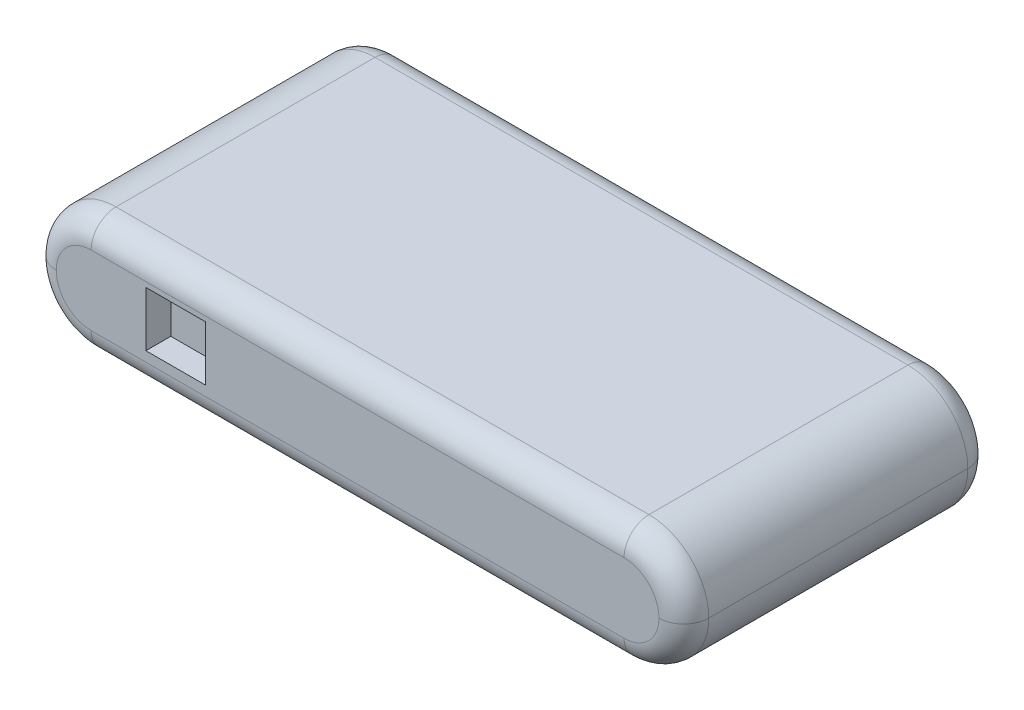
ISO-10303-21;
HEADER;
FILE_DESCRIPTION(('STEP AP214'),'2;1');
FILE_NAME('part.step','',(''),(''),'','','');
FILE_SCHEMA(('AUTOMOTIVE_DESIGN { 1 0 10303 214 1 1 1 1 }'));
ENDSEC;
DATA;
#1=APPLICATION_CONTEXT('core data for automotive mechanical design processes');
#2=APPLICATION_PROTOCOL_DEFINITION('international standard','automotive_design',2000,#1);
#3=PRODUCT_CONTEXT('',#1,'mechanical');
#4=PRODUCT('Part','Part','',(#3));
#5=PRODUCT_RELATED_PRODUCT_CATEGORY('part','',(#4));
#6=PRODUCT_DEFINITION_FORMATION('','',#4);
#7=PRODUCT_DEFINITION_CONTEXT('part definition',#1,'design');
#8=PRODUCT_DEFINITION('design','',#6,#7);
#9=PRODUCT_DEFINITION_SHAPE('','',#8);
#10=(LENGTH_UNIT() NAMED_UNIT(*) SI_UNIT(.MILLI.,.METRE.));
#11=(NAMED_UNIT(*) PLANE_ANGLE_UNIT() SI_UNIT($,.RADIAN.));
#12=(NAMED_UNIT(*) SI_UNIT($,.STERADIAN.) SOLID_ANGLE_UNIT());
#13=UNCERTAINTY_MEASURE_WITH_UNIT(LENGTH_MEASURE(1.E-05),#10,'distance_accuracy_value','');
#14=(GEOMETRIC_REPRESENTATION_CONTEXT(3) GLOBAL_UNCERTAINTY_ASSIGNED_CONTEXT((#13)) GLOBAL_UNIT_ASSIGNED_CONTEXT((#10,
#11,#12)) REPRESENTATION_CONTEXT('',''));
#15=CARTESIAN_POINT('',(0.,0.,0.));
#16=DIRECTION('',(0.,0.,1.));
#17=DIRECTION('',(1.,0.,0.));
#18=AXIS2_PLACEMENT_3D('',#15,#16,#17);
#19=CARTESIAN_POINT('',(-65.5,24.,-31.));
#20=DIRECTION('',(0.,0.,1.));
#21=DIRECTION('',(1.,0.,0.));
#22=AXIS2_PLACEMENT_3D('',#19,#20,#21);
#23=PLANE('',#22);
#24=CARTESIAN_POINT('',(37.5,13.,-31.));
#25=DIRECTION('',(0.,0.,-1.));
#26=DIRECTION('',(-1.,0.,0.));
#27=AXIS2_PLACEMENT_3D('',#24,#25,#26);
#28=CIRCLE('',#27,1.75);
#29=CARTESIAN_POINT('',(35.75,13.,-31.));
#30=VERTEX_POINT('',#29);
#31=EDGE_CURVE('E662',#30,#30,#28,.T.);
#32=ORIENTED_EDGE('',*,*,#31,.F.);
#33=EDGE_LOOP('',(#32));
#34=FACE_BOUND('',#33,.T.);
#35=CARTESIAN_POINT('',(22.5,13.,-31.));
#36=DIRECTION('',(0.,0.,-1.));
#37=DIRECTION('',(-1.,0.,0.));
#38=AXIS2_PLACEMENT_3D('',#35,#36,#37);
#39=CIRCLE('',#38,1.75);
#40=CARTESIAN_POINT('',(20.75,13.,-31.));
#41=VERTEX_POINT('',#40);
#42=EDGE_CURVE('E670',#41,#41,#39,.T.);
#43=ORIENTED_EDGE('',*,*,#42,.F.);
#44=EDGE_LOOP('',(#43));
#45=FACE_BOUND('',#44,.T.);
#46=CARTESIAN_POINT('',(7.50000000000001,13.,-31.));
#47=DIRECTION('',(0.,0.,-1.));
#48=DIRECTION('',(-1.,0.,0.));
#49=AXIS2_PLACEMENT_3D('',#46,#47,#48);
#50=CIRCLE('',#49,1.75);
#51=CARTESIAN_POINT('',(5.75,13.,-31.));
#52=VERTEX_POINT('',#51);
#53=EDGE_CURVE('E676',#52,#52,#50,.T.);
#54=ORIENTED_EDGE('',*,*,#53,.F.);
#55=EDGE_LOOP('',(#54));
#56=FACE_BOUND('',#55,.T.);
#57=CARTESIAN_POINT('',(-7.49999999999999,13.,-31.));
#58=DIRECTION('',(0.,0.,-1.));
#59=DIRECTION('',(-1.,0.,0.));
#60=AXIS2_PLACEMENT_3D('',#57,#58,#59);
#61=CIRCLE('',#60,1.75);
#62=CARTESIAN_POINT('',(-9.25,13.,-31.));
#63=VERTEX_POINT('',#62);
#64=EDGE_CURVE('E682',#63,#63,#61,.T.);
#65=ORIENTED_EDGE('',*,*,#64,.F.);
#66=EDGE_LOOP('',(#65));
#67=FACE_BOUND('',#66,.T.);
#68=CARTESIAN_POINT('',(-22.5,13.,-31.));
#69=DIRECTION('',(0.,0.,-1.));
#70=DIRECTION('',(-1.,0.,0.));
#71=AXIS2_PLACEMENT_3D('',#68,#69,#70);
#72=CIRCLE('',#71,1.75);
#73=CARTESIAN_POINT('',(-24.25,13.,-31.));
#74=VERTEX_POINT('',#73);
#75=EDGE_CURVE('E688',#74,#74,#72,.T.);
#76=ORIENTED_EDGE('',*,*,#75,.F.);
#77=EDGE_LOOP('',(#76));
#78=FACE_BOUND('',#77,.T.);
#79=CARTESIAN_POINT('',(-37.5,13.,-31.));
#80=DIRECTION('',(0.,0.,-1.));
#81=DIRECTION('',(-1.,0.,0.));
#82=AXIS2_PLACEMENT_3D('',#79,#80,#81);
#83=CIRCLE('',#82,1.75);
#84=CARTESIAN_POINT('',(-39.25,13.,-31.));
#85=VERTEX_POINT('',#84);
#86=EDGE_CURVE('E176',#85,#85,#83,.T.);
#87=ORIENTED_EDGE('',*,*,#86,.F.);
#88=EDGE_LOOP('',(#87));
#89=FACE_BOUND('',#88,.T.);
#90=CARTESIAN_POINT('',(53.5,12.,-31.));
#91=DIRECTION('',(0.,0.,1.));
#92=DIRECTION('',(1.,0.,0.));
#93=AXIS2_PLACEMENT_3D('',#90,#91,#92);
#94=CIRCLE('',#93,7.);
#95=CARTESIAN_POINT('',(53.5,19.,-31.));
#96=VERTEX_POINT('',#95);
#97=CARTESIAN_POINT('',(60.5,12.,-31.));
#98=VERTEX_POINT('',#97);
#99=EDGE_CURVE('E218',#96,#98,#94,.F.);
#100=ORIENTED_EDGE('',*,*,#99,.T.);
#101=CARTESIAN_POINT('',(53.5,12.,-31.));
#102=DIRECTION('',(0.,0.,1.));
#103=DIRECTION('',(1.,0.,0.));
#104=AXIS2_PLACEMENT_3D('',#101,#102,#103);
#105=CIRCLE('',#104,7.);
#106=CARTESIAN_POINT('',(53.5,5.,-31.));
#107=VERTEX_POINT('',#106);
#108=EDGE_CURVE('E223',#98,#107,#105,.F.);
#109=ORIENTED_EDGE('',*,*,#108,.T.);
#110=DIRECTION('',(-1.,0.,0.));
#111=VECTOR('',#110,1.);
#112=CARTESIAN_POINT('',(-53.5,5.,-31.));
#113=LINE('',#112,#111);
#114=CARTESIAN_POINT('',(-53.5,5.,-31.));
#115=VERTEX_POINT('',#114);
#116=EDGE_CURVE('E221',#107,#115,#113,.T.);
#117=ORIENTED_EDGE('',*,*,#116,.T.);
#118=CARTESIAN_POINT('',(-53.5,12.,-31.));
#119=DIRECTION('',(0.,0.,1.));
#120=DIRECTION('',(1.,0.,0.));
#121=AXIS2_PLACEMENT_3D('',#118,#119,#120);
#122=CIRCLE('',#121,7.);
#123=CARTESIAN_POINT('',(-60.5,12.,-31.));
#124=VERTEX_POINT('',#123);
#125=EDGE_CURVE('E216',#115,#124,#122,.F.);
#126=ORIENTED_EDGE('',*,*,#125,.T.);
#127=CARTESIAN_POINT('',(-53.5,12.,-31.));
#128=DIRECTION('',(0.,0.,1.));
#129=DIRECTION('',(1.,0.,0.));
#130=AXIS2_PLACEMENT_3D('',#127,#128,#129);
#131=CIRCLE('',#130,7.);
#132=CARTESIAN_POINT('',(-53.5,19.,-31.));
#133=VERTEX_POINT('',#132);
#134=EDGE_CURVE('E214',#124,#133,#131,.F.);
#135=ORIENTED_EDGE('',*,*,#134,.T.);
#136=DIRECTION('',(-1.,0.,0.));
#137=VECTOR('',#136,1.);
#138=CARTESIAN_POINT('',(-65.5,19.,-31.));
#139=LINE('',#138,#137);
#140=EDGE_CURVE('E206',#133,#96,#139,.F.);
#141=ORIENTED_EDGE('',*,*,#140,.T.);
#142=EDGE_LOOP('',(#100,#109,#117,#126,#135,#141));
#143=FACE_BOUND('',#142,.T.);
#144=ADVANCED_FACE('F35',(#34,#45,#56,#67,#78,#89,#143),#23,.F.);
#145=CARTESIAN_POINT('',(-65.5,24.,31.));
#146=DIRECTION('',(0.,0.,-1.));
#147=DIRECTION('',(-1.,0.,0.));
#148=AXIS2_PLACEMENT_3D('',#145,#146,#147);
#149=PLANE('',#148);
#150=DIRECTION('',(1.,0.,0.));
#151=VECTOR('',#150,1.);
#152=CARTESIAN_POINT('',(-42.5,7.,31.));
#153=LINE('',#152,#151);
#154=CARTESIAN_POINT('',(-42.5,7.,31.));
#155=VERTEX_POINT('',#154);
#156=CARTESIAN_POINT('',(-30.5,7.,31.));
#157=VERTEX_POINT('',#156);
#158=EDGE_CURVE('E182',#155,#157,#153,.T.);
#159=ORIENTED_EDGE('',*,*,#158,.F.);
#160=DIRECTION('',(0.,-1.,0.));
#161=VECTOR('',#160,1.);
#162=CARTESIAN_POINT('',(-42.5,18.,31.));
#163=LINE('',#162,#161);
#164=CARTESIAN_POINT('',(-42.5,18.,31.));
#165=VERTEX_POINT('',#164);
#166=EDGE_CURVE('E52',#165,#155,#163,.T.);
#167=ORIENTED_EDGE('',*,*,#166,.F.);
#168=DIRECTION('',(-1.,0.,0.));
#169=VECTOR('',#168,1.);
#170=CARTESIAN_POINT('',(-42.5,18.,31.));
#171=LINE('',#170,#169);
#172=CARTESIAN_POINT('',(-30.5,18.,31.));
#173=VERTEX_POINT('',#172);
#174=EDGE_CURVE('E170',#173,#165,#171,.T.);
#175=ORIENTED_EDGE('',*,*,#174,.F.);
#176=DIRECTION('',(0.,1.,0.));
#177=VECTOR('',#176,1.);
#178=CARTESIAN_POINT('',(-30.5,18.,31.));
#179=LINE('',#178,#177);
#180=EDGE_CURVE('E173',#157,#173,#179,.T.);
#181=ORIENTED_EDGE('',*,*,#180,.F.);
#182=EDGE_LOOP('',(#159,#167,#175,#181));
#183=FACE_BOUND('',#182,.T.);
#184=CARTESIAN_POINT('',(-53.5,12.,31.));
#185=DIRECTION('',(0.,0.,-1.));
#186=DIRECTION('',(-1.,0.,0.));
#187=AXIS2_PLACEMENT_3D('',#184,#185,#186);
#188=CIRCLE('',#187,7.);
#189=CARTESIAN_POINT('',(-53.5,19.,31.));
#190=VERTEX_POINT('',#189);
#191=CARTESIAN_POINT('',(-60.5,12.,31.));
#192=VERTEX_POINT('',#191);
#193=EDGE_CURVE('E249',#190,#192,#188,.F.);
#194=ORIENTED_EDGE('',*,*,#193,.T.);
#195=CARTESIAN_POINT('',(-53.5,12.,31.));
#196=DIRECTION('',(0.,0.,-1.));
#197=DIRECTION('',(-1.,0.,0.));
#198=AXIS2_PLACEMENT_3D('',#195,#196,#197);
#199=CIRCLE('',#198,7.);
#200=CARTESIAN_POINT('',(-53.5,5.,31.));
#201=VERTEX_POINT('',#200);
#202=EDGE_CURVE('E60',#192,#201,#199,.F.);
#203=ORIENTED_EDGE('',*,*,#202,.T.);
#204=DIRECTION('',(1.,0.,0.));
#205=VECTOR('',#204,1.);
#206=CARTESIAN_POINT('',(53.5,5.,31.));
#207=LINE('',#206,#205);
#208=CARTESIAN_POINT('',(53.5,5.,31.));
#209=VERTEX_POINT('',#208);
#210=EDGE_CURVE('E251',#201,#209,#207,.T.);
#211=ORIENTED_EDGE('',*,*,#210,.T.);
#212=CARTESIAN_POINT('',(53.5,12.,31.));
#213=DIRECTION('',(0.,0.,-1.));
#214=DIRECTION('',(-1.,0.,0.));
#215=AXIS2_PLACEMENT_3D('',#212,#213,#214);
#216=CIRCLE('',#215,7.);
#217=CARTESIAN_POINT('',(60.5,12.,31.));
#218=VERTEX_POINT('',#217);
#219=EDGE_CURVE('E247',#209,#218,#216,.F.);
#220=ORIENTED_EDGE('',*,*,#219,.T.);
#221=CARTESIAN_POINT('',(53.5,12.,31.));
#222=DIRECTION('',(0.,0.,-1.));
#223=DIRECTION('',(-1.,0.,0.));
#224=AXIS2_PLACEMENT_3D('',#221,#222,#223);
#225=CIRCLE('',#224,7.);
#226=CARTESIAN_POINT('',(53.5,19.,31.));
#227=VERTEX_POINT('',#226);
#228=EDGE_CURVE('E245',#218,#227,#225,.F.);
#229=ORIENTED_EDGE('',*,*,#228,.T.);
#230=DIRECTION('',(1.,0.,0.));
#231=VECTOR('',#230,1.);
#232=CARTESIAN_POINT('',(-65.5,19.,31.));
#233=LINE('',#232,#231);
#234=EDGE_CURVE('E243',#227,#190,#233,.F.);
#235=ORIENTED_EDGE('',*,*,#234,.T.);
#236=EDGE_LOOP('',(#194,#203,#211,#220,#229,#235));
#237=FACE_BOUND('',#236,.T.);
#238=ADVANCED_FACE('F356',(#183,#237),#149,.F.);
#239=CARTESIAN_POINT('',(0.,24.,0.));
#240=DIRECTION('',(0.,-1.,0.));
#241=DIRECTION('',(0.,0.,-1.));
#242=AXIS2_PLACEMENT_3D('',#239,#240,#241);
#243=PLANE('',#242);
#244=DIRECTION('',(0.,0.,-1.));
#245=VECTOR('',#244,1.);
#246=CARTESIAN_POINT('',(53.5,24.,0.));
#247=LINE('',#246,#245);
#248=CARTESIAN_POINT('',(53.5,24.,26.));
#249=VERTEX_POINT('',#248);
#250=CARTESIAN_POINT('',(53.5,24.,-26.));
#251=VERTEX_POINT('',#250);
#252=EDGE_CURVE('E196',#249,#251,#247,.T.);
#253=ORIENTED_EDGE('',*,*,#252,.T.);
#254=DIRECTION('',(-1.,0.,0.));
#255=VECTOR('',#254,1.);
#256=CARTESIAN_POINT('',(0.,24.,-26.));
#257=LINE('',#256,#255);
#258=CARTESIAN_POINT('',(-53.5,24.,-26.));
#259=VERTEX_POINT('',#258);
#260=EDGE_CURVE('E11',#251,#259,#257,.T.);
#261=ORIENTED_EDGE('',*,*,#260,.T.);
#262=DIRECTION('',(0.,0.,1.));
#263=VECTOR('',#262,1.);
#264=CARTESIAN_POINT('',(-53.5,24.,0.));
#265=LINE('',#264,#263);
#266=CARTESIAN_POINT('',(-53.5,24.,26.));
#267=VERTEX_POINT('',#266);
#268=EDGE_CURVE('E193',#259,#267,#265,.T.);
#269=ORIENTED_EDGE('',*,*,#268,.T.);
#270=DIRECTION('',(1.,0.,0.));
#271=VECTOR('',#270,1.);
#272=CARTESIAN_POINT('',(0.,24.,26.));
#273=LINE('',#272,#271);
#274=EDGE_CURVE('E44',#267,#249,#273,.T.);
#275=ORIENTED_EDGE('',*,*,#274,.T.);
#276=EDGE_LOOP('',(#253,#261,#269,#275));
#277=FACE_BOUND('',#276,.T.);
#278=ADVANCED_FACE('F330',(#277),#243,.F.);
#279=CARTESIAN_POINT('',(0.,0.,0.));
#280=DIRECTION('',(0.,-1.,0.));
#281=DIRECTION('',(0.,0.,-1.));
#282=AXIS2_PLACEMENT_3D('',#279,#280,#281);
#283=PLANE('',#282);
#284=DIRECTION('',(0.,0.,1.));
#285=VECTOR('',#284,1.);
#286=CARTESIAN_POINT('',(-53.5,0.,-31.));
#287=LINE('',#286,#285);
#288=CARTESIAN_POINT('',(-53.5,0.,26.));
#289=VERTEX_POINT('',#288);
#290=CARTESIAN_POINT('',(-53.5,0.,-26.));
#291=VERTEX_POINT('',#290);
#292=EDGE_CURVE('E200',#289,#291,#287,.F.);
#293=ORIENTED_EDGE('',*,*,#292,.T.);
#294=DIRECTION('',(-1.,0.,0.));
#295=VECTOR('',#294,1.);
#296=CARTESIAN_POINT('',(53.5,0.,-26.));
#297=LINE('',#296,#295);
#298=CARTESIAN_POINT('',(53.5,0.,-26.));
#299=VERTEX_POINT('',#298);
#300=EDGE_CURVE('E256',#291,#299,#297,.F.);
#301=ORIENTED_EDGE('',*,*,#300,.T.);
#302=DIRECTION('',(0.,0.,-1.));
#303=VECTOR('',#302,1.);
#304=CARTESIAN_POINT('',(53.5,0.,31.));
#305=LINE('',#304,#303);
#306=CARTESIAN_POINT('',(53.5,0.,26.));
#307=VERTEX_POINT('',#306);
#308=EDGE_CURVE('E203',#299,#307,#305,.F.);
#309=ORIENTED_EDGE('',*,*,#308,.T.);
#310=DIRECTION('',(1.,0.,0.));
#311=VECTOR('',#310,1.);
#312=CARTESIAN_POINT('',(-53.5,0.,26.));
#313=LINE('',#312,#311);
#314=EDGE_CURVE('E254',#307,#289,#313,.F.);
#315=ORIENTED_EDGE('',*,*,#314,.T.);
#316=EDGE_LOOP('',(#293,#301,#309,#315));
#317=FACE_BOUND('',#316,.T.);
#318=ADVANCED_FACE('F303',(#317),#283,.T.);
#319=CARTESIAN_POINT('',(53.5,12.,31.));
#320=DIRECTION('',(0.,0.,1.));
#321=DIRECTION('',(1.,0.,0.));
#322=AXIS2_PLACEMENT_3D('',#319,#320,#321);
#323=CYLINDRICAL_SURFACE('',#322,12.);
#324=ORIENTED_EDGE('',*,*,#308,.F.);
#325=CARTESIAN_POINT('',(53.5,12.,-26.));
#326=DIRECTION('',(0.,0.,1.));
#327=DIRECTION('',(1.,0.,0.));
#328=AXIS2_PLACEMENT_3D('',#325,#326,#327);
#329=CIRCLE('',#328,12.);
#330=CARTESIAN_POINT('',(65.5,12.,-26.));
#331=VERTEX_POINT('',#330);
#332=EDGE_CURVE('E232',#299,#331,#329,.T.);
#333=ORIENTED_EDGE('',*,*,#332,.T.);
#334=DIRECTION('',(0.,0.,-1.));
#335=VECTOR('',#334,1.);
#336=CARTESIAN_POINT('',(65.5,12.,-31.));
#337=LINE('',#336,#335);
#338=CARTESIAN_POINT('',(65.5,12.,26.));
#339=VERTEX_POINT('',#338);
#340=EDGE_CURVE('E197',#339,#331,#337,.T.);
#341=ORIENTED_EDGE('',*,*,#340,.F.);
#342=CARTESIAN_POINT('',(53.5,12.,26.));
#343=DIRECTION('',(0.,0.,-1.));
#344=DIRECTION('',(-1.,0.,0.));
#345=AXIS2_PLACEMENT_3D('',#342,#343,#344);
#346=CIRCLE('',#345,12.);
#347=EDGE_CURVE('E230',#339,#307,#346,.T.);
#348=ORIENTED_EDGE('',*,*,#347,.T.);
#349=EDGE_LOOP('',(#324,#333,#341,#348));
#350=FACE_BOUND('',#349,.T.);
#351=ADVANCED_FACE('F300',(#350),#323,.T.);
#352=CARTESIAN_POINT('',(53.5,12.,0.));
#353=DIRECTION('',(0.,0.,-1.));
#354=DIRECTION('',(-1.,0.,0.));
#355=AXIS2_PLACEMENT_3D('',#352,#353,#354);
#356=CYLINDRICAL_SURFACE('',#355,12.);
#357=ORIENTED_EDGE('',*,*,#340,.T.);
#358=CARTESIAN_POINT('',(53.5,12.,-26.));
#359=DIRECTION('',(0.,0.,1.));
#360=DIRECTION('',(1.,0.,0.));
#361=AXIS2_PLACEMENT_3D('',#358,#359,#360);
#362=CIRCLE('',#361,12.);
#363=EDGE_CURVE('E227',#331,#251,#362,.T.);
#364=ORIENTED_EDGE('',*,*,#363,.T.);
#365=ORIENTED_EDGE('',*,*,#252,.F.);
#366=CARTESIAN_POINT('',(53.5,12.,26.));
#367=DIRECTION('',(0.,0.,-1.));
#368=DIRECTION('',(-1.,0.,0.));
#369=AXIS2_PLACEMENT_3D('',#366,#367,#368);
#370=CIRCLE('',#369,12.);
#371=EDGE_CURVE('E225',#249,#339,#370,.T.);
#372=ORIENTED_EDGE('',*,*,#371,.T.);
#373=EDGE_LOOP('',(#357,#364,#365,#372));
#374=FACE_BOUND('',#373,.T.);
#375=ADVANCED_FACE('F317',(#374),#356,.T.);
#376=CARTESIAN_POINT('',(-53.5,12.,0.));
#377=DIRECTION('',(0.,0.,1.));
#378=DIRECTION('',(1.,0.,0.));
#379=AXIS2_PLACEMENT_3D('',#376,#377,#378);
#380=CYLINDRICAL_SURFACE('',#379,12.);
#381=ORIENTED_EDGE('',*,*,#268,.F.);
#382=CARTESIAN_POINT('',(-53.5,12.,-26.));
#383=DIRECTION('',(0.,0.,1.));
#384=DIRECTION('',(1.,0.,0.));
#385=AXIS2_PLACEMENT_3D('',#382,#383,#384);
#386=CIRCLE('',#385,12.);
#387=CARTESIAN_POINT('',(-65.5,12.,-26.));
#388=VERTEX_POINT('',#387);
#389=EDGE_CURVE('E241',#259,#388,#386,.T.);
#390=ORIENTED_EDGE('',*,*,#389,.T.);
#391=DIRECTION('',(0.,0.,1.));
#392=VECTOR('',#391,1.);
#393=CARTESIAN_POINT('',(-65.5,12.,31.));
#394=LINE('',#393,#392);
#395=CARTESIAN_POINT('',(-65.5,12.,26.));
#396=VERTEX_POINT('',#395);
#397=EDGE_CURVE('E209',#396,#388,#394,.F.);
#398=ORIENTED_EDGE('',*,*,#397,.F.);
#399=CARTESIAN_POINT('',(-53.5,12.,26.));
#400=DIRECTION('',(0.,0.,-1.));
#401=DIRECTION('',(-1.,0.,0.));
#402=AXIS2_PLACEMENT_3D('',#399,#400,#401);
#403=CIRCLE('',#402,12.);
#404=EDGE_CURVE('E238',#396,#267,#403,.T.);
#405=ORIENTED_EDGE('',*,*,#404,.T.);
#406=EDGE_LOOP('',(#381,#390,#398,#405));
#407=FACE_BOUND('',#406,.T.);
#408=ADVANCED_FACE('F333',(#407),#380,.T.);
#409=CARTESIAN_POINT('',(-53.5,12.,31.));
#410=DIRECTION('',(0.,0.,-1.));
#411=DIRECTION('',(-1.,0.,0.));
#412=AXIS2_PLACEMENT_3D('',#409,#410,#411);
#413=CYLINDRICAL_SURFACE('',#412,12.);
#414=ORIENTED_EDGE('',*,*,#397,.T.);
#415=CARTESIAN_POINT('',(-53.5,12.,-26.));
#416=DIRECTION('',(0.,0.,1.));
#417=DIRECTION('',(1.,0.,0.));
#418=AXIS2_PLACEMENT_3D('',#415,#416,#417);
#419=CIRCLE('',#418,12.);
#420=EDGE_CURVE('E236',#388,#291,#419,.T.);
#421=ORIENTED_EDGE('',*,*,#420,.T.);
#422=ORIENTED_EDGE('',*,*,#292,.F.);
#423=CARTESIAN_POINT('',(-53.5,12.,26.));
#424=DIRECTION('',(0.,0.,-1.));
#425=DIRECTION('',(-1.,0.,0.));
#426=AXIS2_PLACEMENT_3D('',#423,#424,#425);
#427=CIRCLE('',#426,12.);
#428=EDGE_CURVE('E234',#289,#396,#427,.T.);
#429=ORIENTED_EDGE('',*,*,#428,.T.);
#430=EDGE_LOOP('',(#414,#421,#422,#429));
#431=FACE_BOUND('',#430,.T.);
#432=ADVANCED_FACE('F345',(#431),#413,.T.);
#433=CARTESIAN_POINT('',(-53.5,12.,-26.));
#434=DIRECTION('',(0.,0.,1.));
#435=DIRECTION('',(1.,0.,0.));
#436=AXIS2_PLACEMENT_3D('',#433,#434,#435);
#437=TOROIDAL_SURFACE('',#436,7.,5.);
#438=CARTESIAN_POINT('',(-53.5,5.,-26.));
#439=DIRECTION('',(1.,0.,0.));
#440=DIRECTION('',(0.,0.,-1.));
#441=AXIS2_PLACEMENT_3D('',#438,#439,#440);
#442=CIRCLE('',#441,5.);
#443=EDGE_CURVE('E269',#291,#115,#442,.T.);
#444=ORIENTED_EDGE('',*,*,#443,.F.);
#445=ORIENTED_EDGE('',*,*,#420,.F.);
#446=CARTESIAN_POINT('',(-60.5,12.,-26.));
#447=DIRECTION('',(0.,1.,0.));
#448=DIRECTION('',(0.,0.,1.));
#449=AXIS2_PLACEMENT_3D('',#446,#447,#448);
#450=CIRCLE('',#449,5.);
#451=EDGE_CURVE('E212',#124,#388,#450,.T.);
#452=ORIENTED_EDGE('',*,*,#451,.F.);
#453=ORIENTED_EDGE('',*,*,#125,.F.);
#454=EDGE_LOOP('',(#444,#445,#452,#453));
#455=FACE_BOUND('',#454,.T.);
#456=ADVANCED_FACE('F343',(#455),#437,.T.);
#457=CARTESIAN_POINT('',(-53.5,12.,-26.));
#458=DIRECTION('',(0.,0.,1.));
#459=DIRECTION('',(1.,0.,0.));
#460=AXIS2_PLACEMENT_3D('',#457,#458,#459);
#461=TOROIDAL_SURFACE('',#460,7.,5.);
#462=ORIENTED_EDGE('',*,*,#451,.T.);
#463=ORIENTED_EDGE('',*,*,#389,.F.);
#464=CARTESIAN_POINT('',(-53.5,19.,-26.));
#465=DIRECTION('',(1.,0.,0.));
#466=DIRECTION('',(0.,0.,-1.));
#467=AXIS2_PLACEMENT_3D('',#464,#465,#466);
#468=CIRCLE('',#467,5.);
#469=EDGE_CURVE('E266',#133,#259,#468,.T.);
#470=ORIENTED_EDGE('',*,*,#469,.F.);
#471=ORIENTED_EDGE('',*,*,#134,.F.);
#472=EDGE_LOOP('',(#462,#463,#470,#471));
#473=FACE_BOUND('',#472,.T.);
#474=ADVANCED_FACE('F337',(#473),#461,.T.);
#475=CARTESIAN_POINT('',(-65.5,5.,-26.));
#476=DIRECTION('',(1.,0.,0.));
#477=DIRECTION('',(0.,0.,-1.));
#478=AXIS2_PLACEMENT_3D('',#475,#476,#477);
#479=CYLINDRICAL_SURFACE('',#478,5.);
#480=ORIENTED_EDGE('',*,*,#443,.T.);
#481=ORIENTED_EDGE('',*,*,#116,.F.);
#482=CARTESIAN_POINT('',(53.5,5.,-26.));
#483=DIRECTION('',(1.,0.,0.));
#484=DIRECTION('',(0.,0.,-1.));
#485=AXIS2_PLACEMENT_3D('',#482,#483,#484);
#486=CIRCLE('',#485,5.);
#487=EDGE_CURVE('E263',#299,#107,#486,.T.);
#488=ORIENTED_EDGE('',*,*,#487,.F.);
#489=ORIENTED_EDGE('',*,*,#300,.F.);
#490=EDGE_LOOP('',(#480,#481,#488,#489));
#491=FACE_BOUND('',#490,.T.);
#492=ADVANCED_FACE('F308',(#491),#479,.T.);
#493=CARTESIAN_POINT('',(0.,19.,-26.));
#494=DIRECTION('',(-1.,0.,0.));
#495=DIRECTION('',(0.,0.,1.));
#496=AXIS2_PLACEMENT_3D('',#493,#494,#495);
#497=CYLINDRICAL_SURFACE('',#496,5.);
#498=ORIENTED_EDGE('',*,*,#469,.T.);
#499=ORIENTED_EDGE('',*,*,#260,.F.);
#500=CARTESIAN_POINT('',(53.5,19.,-26.));
#501=DIRECTION('',(1.,0.,0.));
#502=DIRECTION('',(0.,0.,-1.));
#503=AXIS2_PLACEMENT_3D('',#500,#501,#502);
#504=CIRCLE('',#503,5.);
#505=EDGE_CURVE('E261',#96,#251,#504,.T.);
#506=ORIENTED_EDGE('',*,*,#505,.F.);
#507=ORIENTED_EDGE('',*,*,#140,.F.);
#508=EDGE_LOOP('',(#498,#499,#506,#507));
#509=FACE_BOUND('',#508,.T.);
#510=ADVANCED_FACE('F326',(#509),#497,.T.);
#511=CARTESIAN_POINT('',(53.5,12.,-26.));
#512=DIRECTION('',(0.,0.,1.));
#513=DIRECTION('',(1.,0.,0.));
#514=AXIS2_PLACEMENT_3D('',#511,#512,#513);
#515=TOROIDAL_SURFACE('',#514,7.,5.);
#516=ORIENTED_EDGE('',*,*,#487,.T.);
#517=ORIENTED_EDGE('',*,*,#108,.F.);
#518=CARTESIAN_POINT('',(60.5,12.,-26.));
#519=DIRECTION('',(0.,1.,0.));
#520=DIRECTION('',(0.,0.,1.));
#521=AXIS2_PLACEMENT_3D('',#518,#519,#520);
#522=CIRCLE('',#521,5.);
#523=EDGE_CURVE('E259',#331,#98,#522,.T.);
#524=ORIENTED_EDGE('',*,*,#523,.F.);
#525=ORIENTED_EDGE('',*,*,#332,.F.);
#526=EDGE_LOOP('',(#516,#517,#524,#525));
#527=FACE_BOUND('',#526,.T.);
#528=ADVANCED_FACE('F314',(#527),#515,.T.);
#529=CARTESIAN_POINT('',(53.5,12.,-26.));
#530=DIRECTION('',(0.,0.,1.));
#531=DIRECTION('',(1.,0.,0.));
#532=AXIS2_PLACEMENT_3D('',#529,#530,#531);
#533=TOROIDAL_SURFACE('',#532,7.,5.);
#534=ORIENTED_EDGE('',*,*,#505,.T.);
#535=ORIENTED_EDGE('',*,*,#363,.F.);
#536=ORIENTED_EDGE('',*,*,#523,.T.);
#537=ORIENTED_EDGE('',*,*,#99,.F.);
#538=EDGE_LOOP('',(#534,#535,#536,#537));
#539=FACE_BOUND('',#538,.T.);
#540=ADVANCED_FACE('F320',(#539),#533,.T.);
#541=CARTESIAN_POINT('',(53.5,12.,26.));
#542=DIRECTION('',(0.,0.,-1.));
#543=DIRECTION('',(-1.,0.,0.));
#544=AXIS2_PLACEMENT_3D('',#541,#542,#543);
#545=TOROIDAL_SURFACE('',#544,7.,5.);
#546=CARTESIAN_POINT('',(53.5,5.,26.));
#547=DIRECTION('',(-1.,0.,0.));
#548=DIRECTION('',(0.,0.,1.));
#549=AXIS2_PLACEMENT_3D('',#546,#547,#548);
#550=CIRCLE('',#549,5.);
#551=EDGE_CURVE('E282',#307,#209,#550,.T.);
#552=ORIENTED_EDGE('',*,*,#551,.F.);
#553=ORIENTED_EDGE('',*,*,#347,.F.);
#554=CARTESIAN_POINT('',(60.5,12.,26.));
#555=DIRECTION('',(0.,1.,0.));
#556=DIRECTION('',(0.,0.,1.));
#557=AXIS2_PLACEMENT_3D('',#554,#555,#556);
#558=CIRCLE('',#557,5.);
#559=EDGE_CURVE('E39',#218,#339,#558,.T.);
#560=ORIENTED_EDGE('',*,*,#559,.F.);
#561=ORIENTED_EDGE('',*,*,#219,.F.);
#562=EDGE_LOOP('',(#552,#553,#560,#561));
#563=FACE_BOUND('',#562,.T.);
#564=ADVANCED_FACE('F37',(#563),#545,.T.);
#565=CARTESIAN_POINT('',(53.5,12.,26.));
#566=DIRECTION('',(0.,0.,-1.));
#567=DIRECTION('',(-1.,0.,0.));
#568=AXIS2_PLACEMENT_3D('',#565,#566,#567);
#569=TOROIDAL_SURFACE('',#568,7.,5.);
#570=ORIENTED_EDGE('',*,*,#559,.T.);
#571=ORIENTED_EDGE('',*,*,#371,.F.);
#572=CARTESIAN_POINT('',(53.5,19.,26.));
#573=DIRECTION('',(-1.,0.,0.));
#574=DIRECTION('',(0.,0.,1.));
#575=AXIS2_PLACEMENT_3D('',#572,#573,#574);
#576=CIRCLE('',#575,5.);
#577=EDGE_CURVE('E280',#227,#249,#576,.T.);
#578=ORIENTED_EDGE('',*,*,#577,.F.);
#579=ORIENTED_EDGE('',*,*,#228,.F.);
#580=EDGE_LOOP('',(#570,#571,#578,#579));
#581=FACE_BOUND('',#580,.T.);
#582=ADVANCED_FACE('F292',(#581),#569,.T.);
#583=CARTESIAN_POINT('',(-65.5,5.,26.));
#584=DIRECTION('',(-1.,0.,0.));
#585=DIRECTION('',(0.,0.,1.));
#586=AXIS2_PLACEMENT_3D('',#583,#584,#585);
#587=CYLINDRICAL_SURFACE('',#586,5.);
#588=ORIENTED_EDGE('',*,*,#551,.T.);
#589=ORIENTED_EDGE('',*,*,#210,.F.);
#590=CARTESIAN_POINT('',(-53.5,5.,26.));
#591=DIRECTION('',(-1.,0.,0.));
#592=DIRECTION('',(0.,0.,1.));
#593=AXIS2_PLACEMENT_3D('',#590,#591,#592);
#594=CIRCLE('',#593,5.);
#595=EDGE_CURVE('E277',#289,#201,#594,.T.);
#596=ORIENTED_EDGE('',*,*,#595,.F.);
#597=ORIENTED_EDGE('',*,*,#314,.F.);
#598=EDGE_LOOP('',(#588,#589,#596,#597));
#599=FACE_BOUND('',#598,.T.);
#600=ADVANCED_FACE('F361',(#599),#587,.T.);
#601=CARTESIAN_POINT('',(0.,19.,26.));
#602=DIRECTION('',(1.,0.,0.));
#603=DIRECTION('',(0.,0.,-1.));
#604=AXIS2_PLACEMENT_3D('',#601,#602,#603);
#605=CYLINDRICAL_SURFACE('',#604,5.);
#606=ORIENTED_EDGE('',*,*,#577,.T.);
#607=ORIENTED_EDGE('',*,*,#274,.F.);
#608=CARTESIAN_POINT('',(-53.5,19.,26.));
#609=DIRECTION('',(-1.,0.,0.));
#610=DIRECTION('',(0.,0.,1.));
#611=AXIS2_PLACEMENT_3D('',#608,#609,#610);
#612=CIRCLE('',#611,5.);
#613=EDGE_CURVE('E275',#190,#267,#612,.T.);
#614=ORIENTED_EDGE('',*,*,#613,.F.);
#615=ORIENTED_EDGE('',*,*,#234,.F.);
#616=EDGE_LOOP('',(#606,#607,#614,#615));
#617=FACE_BOUND('',#616,.T.);
#618=ADVANCED_FACE('F359',(#617),#605,.T.);
#619=CARTESIAN_POINT('',(-53.5,12.,26.));
#620=DIRECTION('',(0.,0.,-1.));
#621=DIRECTION('',(-1.,0.,0.));
#622=AXIS2_PLACEMENT_3D('',#619,#620,#621);
#623=TOROIDAL_SURFACE('',#622,7.,5.);
#624=ORIENTED_EDGE('',*,*,#595,.T.);
#625=ORIENTED_EDGE('',*,*,#202,.F.);
#626=CARTESIAN_POINT('',(-60.5,12.,26.));
#627=DIRECTION('',(0.,1.,0.));
#628=DIRECTION('',(0.,0.,1.));
#629=AXIS2_PLACEMENT_3D('',#626,#627,#628);
#630=CIRCLE('',#629,5.);
#631=EDGE_CURVE('E189',#396,#192,#630,.T.);
#632=ORIENTED_EDGE('',*,*,#631,.F.);
#633=ORIENTED_EDGE('',*,*,#428,.F.);
#634=EDGE_LOOP('',(#624,#625,#632,#633));
#635=FACE_BOUND('',#634,.T.);
#636=ADVANCED_FACE('F355',(#635),#623,.T.);
#637=CARTESIAN_POINT('',(-53.5,12.,26.));
#638=DIRECTION('',(0.,0.,-1.));
#639=DIRECTION('',(-1.,0.,0.));
#640=AXIS2_PLACEMENT_3D('',#637,#638,#639);
#641=TOROIDAL_SURFACE('',#640,7.,5.);
#642=ORIENTED_EDGE('',*,*,#613,.T.);
#643=ORIENTED_EDGE('',*,*,#404,.F.);
#644=ORIENTED_EDGE('',*,*,#631,.T.);
#645=ORIENTED_EDGE('',*,*,#193,.F.);
#646=EDGE_LOOP('',(#642,#643,#644,#645));
#647=FACE_BOUND('',#646,.T.);
#648=ADVANCED_FACE('F350',(#647),#641,.T.);
#649=CARTESIAN_POINT('',(-42.5,18.,26.));
#650=DIRECTION('',(-1.,0.,0.));
#651=DIRECTION('',(0.,0.,1.));
#652=AXIS2_PLACEMENT_3D('',#649,#650,#651);
#653=PLANE('',#652);
#654=ORIENTED_EDGE('',*,*,#166,.T.);
#655=DIRECTION('',(0.,0.,1.));
#656=VECTOR('',#655,1.);
#657=CARTESIAN_POINT('',(-42.5,7.,26.));
#658=LINE('',#657,#656);
#659=CARTESIAN_POINT('',(-42.5,7.,26.));
#660=VERTEX_POINT('',#659);
#661=EDGE_CURVE('E148',#660,#155,#658,.T.);
#662=ORIENTED_EDGE('',*,*,#661,.F.);
#663=DIRECTION('',(0.,-1.,0.));
#664=VECTOR('',#663,1.);
#665=CARTESIAN_POINT('',(-42.5,18.,26.));
#666=LINE('',#665,#664);
#667=CARTESIAN_POINT('',(-42.5,18.,26.));
#668=VERTEX_POINT('',#667);
#669=EDGE_CURVE('E152',#668,#660,#666,.T.);
#670=ORIENTED_EDGE('',*,*,#669,.F.);
#671=DIRECTION('',(0.,0.,1.));
#672=VECTOR('',#671,1.);
#673=CARTESIAN_POINT('',(-42.5,18.,26.));
#674=LINE('',#673,#672);
#675=EDGE_CURVE('E187',#668,#165,#674,.T.);
#676=ORIENTED_EDGE('',*,*,#675,.T.);
#677=EDGE_LOOP('',(#654,#662,#670,#676));
#678=FACE_BOUND('',#677,.T.);
#679=ADVANCED_FACE('F150',(#678),#653,.F.);
#680=CARTESIAN_POINT('',(-42.5,18.,26.));
#681=DIRECTION('',(0.,1.,0.));
#682=DIRECTION('',(0.,0.,1.));
#683=AXIS2_PLACEMENT_3D('',#680,#681,#682);
#684=PLANE('',#683);
#685=ORIENTED_EDGE('',*,*,#174,.T.);
#686=ORIENTED_EDGE('',*,*,#675,.F.);
#687=DIRECTION('',(-1.,0.,0.));
#688=VECTOR('',#687,1.);
#689=CARTESIAN_POINT('',(-42.5,18.,26.));
#690=LINE('',#689,#688);
#691=CARTESIAN_POINT('',(-30.5,18.,26.));
#692=VERTEX_POINT('',#691);
#693=EDGE_CURVE('E158',#692,#668,#690,.T.);
#694=ORIENTED_EDGE('',*,*,#693,.F.);
#695=DIRECTION('',(0.,0.,1.));
#696=VECTOR('',#695,1.);
#697=CARTESIAN_POINT('',(-30.5,18.,26.));
#698=LINE('',#697,#696);
#699=EDGE_CURVE('E190',#692,#173,#698,.T.);
#700=ORIENTED_EDGE('',*,*,#699,.T.);
#701=EDGE_LOOP('',(#685,#686,#694,#700));
#702=FACE_BOUND('',#701,.T.);
#703=ADVANCED_FACE('F405',(#702),#684,.F.);
#704=CARTESIAN_POINT('',(-30.5,18.,26.));
#705=DIRECTION('',(1.,0.,0.));
#706=DIRECTION('',(0.,1.,0.));
#707=AXIS2_PLACEMENT_3D('',#704,#705,#706);
#708=PLANE('',#707);
#709=ORIENTED_EDGE('',*,*,#180,.T.);
#710=ORIENTED_EDGE('',*,*,#699,.F.);
#711=DIRECTION('',(0.,1.,0.));
#712=VECTOR('',#711,1.);
#713=CARTESIAN_POINT('',(-30.5,18.,26.));
#714=LINE('',#713,#712);
#715=CARTESIAN_POINT('',(-30.5,7.,26.));
#716=VERTEX_POINT('',#715);
#717=EDGE_CURVE('E166',#716,#692,#714,.T.);
#718=ORIENTED_EDGE('',*,*,#717,.F.);
#719=DIRECTION('',(0.,0.,1.));
#720=VECTOR('',#719,1.);
#721=CARTESIAN_POINT('',(-30.5,7.,26.));
#722=LINE('',#721,#720);
#723=EDGE_CURVE('E157',#716,#157,#722,.T.);
#724=ORIENTED_EDGE('',*,*,#723,.T.);
#725=EDGE_LOOP('',(#709,#710,#718,#724));
#726=FACE_BOUND('',#725,.T.);
#727=ADVANCED_FACE('F410',(#726),#708,.F.);
#728=CARTESIAN_POINT('',(-42.5,7.,26.));
#729=DIRECTION('',(0.,-1.,0.));
#730=DIRECTION('',(1.,0.,0.));
#731=AXIS2_PLACEMENT_3D('',#728,#729,#730);
#732=PLANE('',#731);
#733=ORIENTED_EDGE('',*,*,#158,.T.);
#734=ORIENTED_EDGE('',*,*,#723,.F.);
#735=DIRECTION('',(1.,0.,0.));
#736=VECTOR('',#735,1.);
#737=CARTESIAN_POINT('',(-42.5,7.,26.));
#738=LINE('',#737,#736);
#739=EDGE_CURVE('E161',#660,#716,#738,.T.);
#740=ORIENTED_EDGE('',*,*,#739,.F.);
#741=ORIENTED_EDGE('',*,*,#661,.T.);
#742=EDGE_LOOP('',(#733,#734,#740,#741));
#743=FACE_BOUND('',#742,.T.);
#744=ADVANCED_FACE('F162',(#743),#732,.F.);
#745=CARTESIAN_POINT('',(0.,0.,26.));
#746=DIRECTION('',(0.,0.,1.));
#747=DIRECTION('',(1.,0.,0.));
#748=AXIS2_PLACEMENT_3D('',#745,#746,#747);
#749=PLANE('',#748);
#750=ORIENTED_EDGE('',*,*,#669,.T.);
#751=ORIENTED_EDGE('',*,*,#739,.T.);
#752=ORIENTED_EDGE('',*,*,#717,.T.);
#753=ORIENTED_EDGE('',*,*,#693,.T.);
#754=EDGE_LOOP('',(#750,#751,#752,#753));
#755=FACE_BOUND('',#754,.T.);
#756=ADVANCED_FACE('F168',(#755),#749,.T.);
#757=CARTESIAN_POINT('',(-37.5,13.,-26.));
#758=DIRECTION('',(0.,0.,-1.));
#759=DIRECTION('',(-1.,0.,0.));
#760=AXIS2_PLACEMENT_3D('',#757,#758,#759);
#761=CYLINDRICAL_SURFACE('',#760,1.75);
#762=CARTESIAN_POINT('',(-37.5,13.,-26.));
#763=DIRECTION('',(0.,0.,-1.));
#764=DIRECTION('',(-1.,0.,0.));
#765=AXIS2_PLACEMENT_3D('',#762,#763,#764);
#766=CIRCLE('',#765,1.75);
#767=CARTESIAN_POINT('',(-39.25,13.,-26.));
#768=VERTEX_POINT('',#767);
#769=EDGE_CURVE('E690',#768,#768,#766,.T.);
#770=ORIENTED_EDGE('',*,*,#769,.F.);
#771=EDGE_LOOP('',(#770));
#772=FACE_BOUND('',#771,.T.);
#773=ORIENTED_EDGE('',*,*,#86,.T.);
#774=EDGE_LOOP('',(#773));
#775=FACE_BOUND('',#774,.T.);
#776=ADVANCED_FACE('F533',(#772,#775),#761,.F.);
#777=CARTESIAN_POINT('',(-37.5,13.,-26.));
#778=DIRECTION('',(0.,0.,-1.));
#779=DIRECTION('',(-1.,0.,0.));
#780=AXIS2_PLACEMENT_3D('',#777,#778,#779);
#781=PLANE('',#780);
#782=ORIENTED_EDGE('',*,*,#769,.T.);
#783=EDGE_LOOP('',(#782));
#784=FACE_BOUND('',#783,.T.);
#785=ADVANCED_FACE('F546',(#784),#781,.T.);
#786=CARTESIAN_POINT('',(-22.5,13.,-26.));
#787=DIRECTION('',(0.,0.,-1.));
#788=DIRECTION('',(-1.,0.,0.));
#789=AXIS2_PLACEMENT_3D('',#786,#787,#788);
#790=CYLINDRICAL_SURFACE('',#789,1.75);
#791=CARTESIAN_POINT('',(-22.5,13.,-26.));
#792=DIRECTION('',(0.,0.,-1.));
#793=DIRECTION('',(-1.,0.,0.));
#794=AXIS2_PLACEMENT_3D('',#791,#792,#793);
#795=CIRCLE('',#794,1.75);
#796=CARTESIAN_POINT('',(-24.25,13.,-26.));
#797=VERTEX_POINT('',#796);
#798=EDGE_CURVE('E685',#797,#797,#795,.T.);
#799=ORIENTED_EDGE('',*,*,#798,.F.);
#800=EDGE_LOOP('',(#799));
#801=FACE_BOUND('',#800,.T.);
#802=ORIENTED_EDGE('',*,*,#75,.T.);
#803=EDGE_LOOP('',(#802));
#804=FACE_BOUND('',#803,.T.);
#805=ADVANCED_FACE('F556',(#801,#804),#790,.F.);
#806=CARTESIAN_POINT('',(-22.5,13.,-26.));
#807=DIRECTION('',(0.,0.,-1.));
#808=DIRECTION('',(-1.,0.,0.));
#809=AXIS2_PLACEMENT_3D('',#806,#807,#808);
#810=PLANE('',#809);
#811=ORIENTED_EDGE('',*,*,#798,.T.);
#812=EDGE_LOOP('',(#811));
#813=FACE_BOUND('',#812,.T.);
#814=ADVANCED_FACE('F566',(#813),#810,.T.);
#815=CARTESIAN_POINT('',(-7.49999999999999,13.,-26.));
#816=DIRECTION('',(0.,0.,-1.));
#817=DIRECTION('',(-1.,0.,0.));
#818=AXIS2_PLACEMENT_3D('',#815,#816,#817);
#819=CYLINDRICAL_SURFACE('',#818,1.75);
#820=CARTESIAN_POINT('',(-7.49999999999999,13.,-26.));
#821=DIRECTION('',(0.,0.,-1.));
#822=DIRECTION('',(-1.,0.,0.));
#823=AXIS2_PLACEMENT_3D('',#820,#821,#822);
#824=CIRCLE('',#823,1.75);
#825=CARTESIAN_POINT('',(-9.25,13.,-26.));
#826=VERTEX_POINT('',#825);
#827=EDGE_CURVE('E679',#826,#826,#824,.T.);
#828=ORIENTED_EDGE('',*,*,#827,.F.);
#829=EDGE_LOOP('',(#828));
#830=FACE_BOUND('',#829,.T.);
#831=ORIENTED_EDGE('',*,*,#64,.T.);
#832=EDGE_LOOP('',(#831));
#833=FACE_BOUND('',#832,.T.);
#834=ADVANCED_FACE('F576',(#830,#833),#819,.F.);
#835=CARTESIAN_POINT('',(-7.49999999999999,13.,-26.));
#836=DIRECTION('',(0.,0.,-1.));
#837=DIRECTION('',(-1.,0.,0.));
#838=AXIS2_PLACEMENT_3D('',#835,#836,#837);
#839=PLANE('',#838);
#840=ORIENTED_EDGE('',*,*,#827,.T.);
#841=EDGE_LOOP('',(#840));
#842=FACE_BOUND('',#841,.T.);
#843=ADVANCED_FACE('F586',(#842),#839,.T.);
#844=CARTESIAN_POINT('',(7.50000000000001,13.,-26.));
#845=DIRECTION('',(0.,0.,-1.));
#846=DIRECTION('',(-1.,0.,0.));
#847=AXIS2_PLACEMENT_3D('',#844,#845,#846);
#848=CYLINDRICAL_SURFACE('',#847,1.75);
#849=CARTESIAN_POINT('',(7.50000000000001,13.,-26.));
#850=DIRECTION('',(0.,0.,-1.));
#851=DIRECTION('',(-1.,0.,0.));
#852=AXIS2_PLACEMENT_3D('',#849,#850,#851);
#853=CIRCLE('',#852,1.75);
#854=CARTESIAN_POINT('',(5.75,13.,-26.));
#855=VERTEX_POINT('',#854);
#856=EDGE_CURVE('E673',#855,#855,#853,.T.);
#857=ORIENTED_EDGE('',*,*,#856,.F.);
#858=EDGE_LOOP('',(#857));
#859=FACE_BOUND('',#858,.T.);
#860=ORIENTED_EDGE('',*,*,#53,.T.);
#861=EDGE_LOOP('',(#860));
#862=FACE_BOUND('',#861,.T.);
#863=ADVANCED_FACE('F596',(#859,#862),#848,.F.);
#864=CARTESIAN_POINT('',(7.50000000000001,13.,-26.));
#865=DIRECTION('',(0.,0.,-1.));
#866=DIRECTION('',(-1.,0.,0.));
#867=AXIS2_PLACEMENT_3D('',#864,#865,#866);
#868=PLANE('',#867);
#869=ORIENTED_EDGE('',*,*,#856,.T.);
#870=EDGE_LOOP('',(#869));
#871=FACE_BOUND('',#870,.T.);
#872=ADVANCED_FACE('F606',(#871),#868,.T.);
#873=CARTESIAN_POINT('',(22.5,13.,-26.));
#874=DIRECTION('',(0.,0.,-1.));
#875=DIRECTION('',(-1.,0.,0.));
#876=AXIS2_PLACEMENT_3D('',#873,#874,#875);
#877=CYLINDRICAL_SURFACE('',#876,1.75);
#878=CARTESIAN_POINT('',(22.5,13.,-26.));
#879=DIRECTION('',(0.,0.,-1.));
#880=DIRECTION('',(-1.,0.,0.));
#881=AXIS2_PLACEMENT_3D('',#878,#879,#880);
#882=CIRCLE('',#881,1.75);
#883=CARTESIAN_POINT('',(20.75,13.,-26.));
#884=VERTEX_POINT('',#883);
#885=EDGE_CURVE('E665',#884,#884,#882,.T.);
#886=ORIENTED_EDGE('',*,*,#885,.F.);
#887=EDGE_LOOP('',(#886));
#888=FACE_BOUND('',#887,.T.);
#889=ORIENTED_EDGE('',*,*,#42,.T.);
#890=EDGE_LOOP('',(#889));
#891=FACE_BOUND('',#890,.T.);
#892=ADVANCED_FACE('F616',(#888,#891),#877,.F.);
#893=CARTESIAN_POINT('',(22.5,13.,-26.));
#894=DIRECTION('',(0.,0.,-1.));
#895=DIRECTION('',(-1.,0.,0.));
#896=AXIS2_PLACEMENT_3D('',#893,#894,#895);
#897=PLANE('',#896);
#898=ORIENTED_EDGE('',*,*,#885,.T.);
#899=EDGE_LOOP('',(#898));
#900=FACE_BOUND('',#899,.T.);
#901=ADVANCED_FACE('F626',(#900),#897,.T.);
#902=CARTESIAN_POINT('',(37.5,13.,-26.));
#903=DIRECTION('',(0.,0.,-1.));
#904=DIRECTION('',(-1.,0.,0.));
#905=AXIS2_PLACEMENT_3D('',#902,#903,#904);
#906=CYLINDRICAL_SURFACE('',#905,1.75);
#907=CARTESIAN_POINT('',(37.5,13.,-26.));
#908=DIRECTION('',(0.,0.,-1.));
#909=DIRECTION('',(-1.,0.,0.));
#910=AXIS2_PLACEMENT_3D('',#907,#908,#909);
#911=CIRCLE('',#910,1.75);
#912=CARTESIAN_POINT('',(35.75,13.,-26.));
#913=VERTEX_POINT('',#912);
#914=EDGE_CURVE('E183',#913,#913,#911,.T.);
#915=ORIENTED_EDGE('',*,*,#914,.F.);
#916=EDGE_LOOP('',(#915));
#917=FACE_BOUND('',#916,.T.);
#918=ORIENTED_EDGE('',*,*,#31,.T.);
#919=EDGE_LOOP('',(#918));
#920=FACE_BOUND('',#919,.T.);
#921=ADVANCED_FACE('F636',(#917,#920),#906,.F.);
#922=CARTESIAN_POINT('',(37.5,13.,-26.));
#923=DIRECTION('',(0.,0.,-1.));
#924=DIRECTION('',(-1.,0.,0.));
#925=AXIS2_PLACEMENT_3D('',#922,#923,#924);
#926=PLANE('',#925);
#927=ORIENTED_EDGE('',*,*,#914,.T.);
#928=EDGE_LOOP('',(#927));
#929=FACE_BOUND('',#928,.T.);
#930=ADVANCED_FACE('F646',(#929),#926,.T.);
#931=CLOSED_SHELL('',(#144,#238,#278,#318,#351,#375,#408,#432,#456,#474,#492,#510,#528,#540,
#564,#582,#600,#618,#636,#648,#679,#703,#727,#744,#756,#776,#785,#805,#814,#834,#843,#863,#872,
#892,#901,#921,#930));
#932=MANIFOLD_SOLID_BREP('B2',#931);
#933=ADVANCED_BREP_SHAPE_REPRESENTATION('',(#18,#932),#14);
#934=SHAPE_DEFINITION_REPRESENTATION(#9,#933);
ENDSEC;
END-ISO-10303-21;
